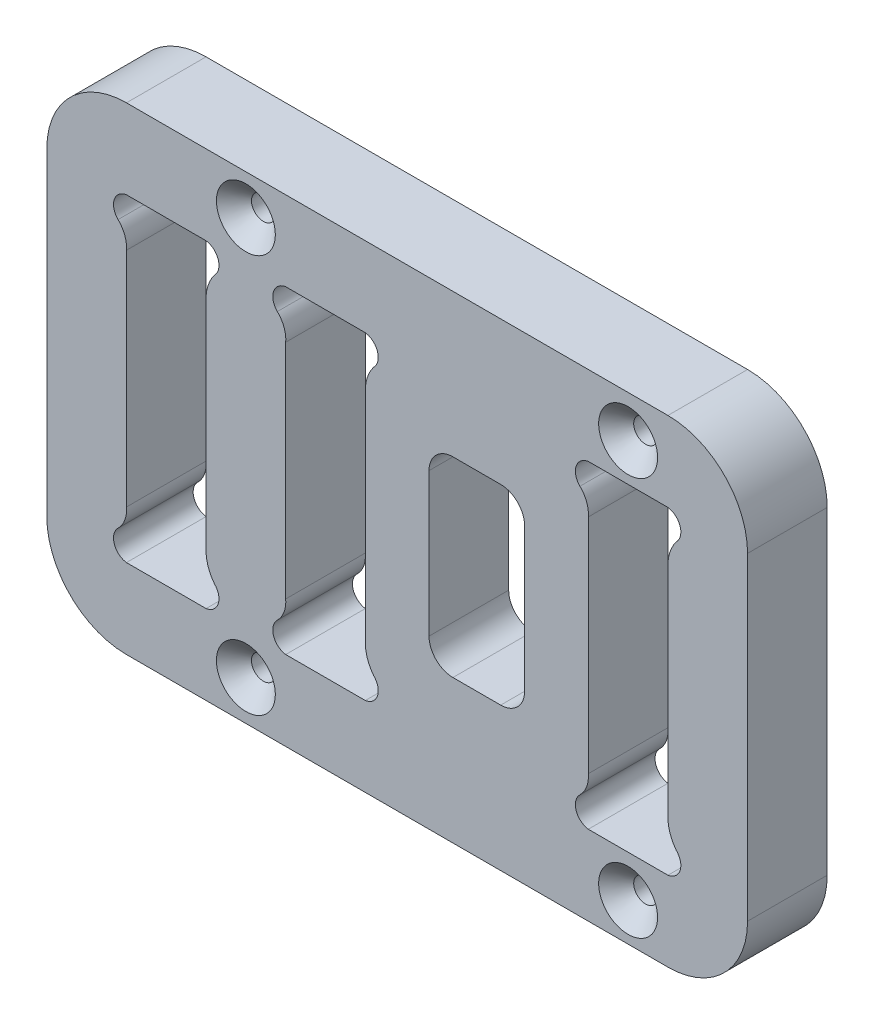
from build123d import *

# Parameters (mm, degrees)
ESQUISSE1_R             = 1.5
BOSS_EXTRU_1_DEPTH      = 10
CHANFREIN1_SIZE         = 2.2
ENL_V_MAT_EXTRU_1_DEPTH = 190.358078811


with BuildPart() as part:
    # Esquisse1 → Boss.-Extru.1 (new body)
    with BuildSketch(Plane.XY):
        with BuildLine():
            Line((-87.488267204, 20.429752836), (-87.488267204, 60.429752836))
            ThreePointArc((-87.488267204, 60.429752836), (-90.417199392, 67.500820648), (-97.488267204, 70.429752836))
            Line((-97.488267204, 70.429752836), (-165.488267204, 70.429752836))
            ThreePointArc((-165.488267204, 70.429752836), (-172.559335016, 67.500820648), (-175.488267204, 60.429752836))
            Line((-175.488267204, 60.429752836), (-175.488267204, 20.429752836))
            ThreePointArc((-175.488267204, 20.429752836), (-172.559335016, 13.358685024), (-165.488267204, 10.429752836))
            Line((-165.488267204, 10.429752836), (-97.488267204, 10.429752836))
            ThreePointArc((-97.488267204, 10.429752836), (-90.417199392, 13.358685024), (-87.488267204, 20.429752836))
        make_face()
        with Locations((-150.488267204, 65.429752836)):
            Circle(ESQUISSE1_R, mode=Mode.SUBTRACT)
        with Locations(Location((-150.488267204, 15.429752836, 0), (0, 0, 180))):
            Circle(ESQUISSE1_R, mode=Mode.SUBTRACT)
        with Locations((-102.488267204, 65.19100666)):
            Circle(ESQUISSE1_R, mode=Mode.SUBTRACT)
        with Locations(Location((-102.488267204, 15.19100666, 0), (0, 0, 180))):
            Circle(ESQUISSE1_R, mode=Mode.SUBTRACT)
        with BuildLine():
            Line((-145.488267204, 60.429752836), (-135.488267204, 60.429752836))
            ThreePointArc((-135.488267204, 60.429752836), (-133.959475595, 59.144976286), (-134.439504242, 57.206567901))
            ThreePointArc((-134.439504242, 57.206567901), (-135.175994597, 55.877234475), (-135.488267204, 54.389944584))
            Line((-135.488267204, 54.389944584), (-135.488267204, 26.469561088))
            ThreePointArc((-135.488267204, 26.469561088), (-135.175994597, 24.982271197), (-134.439504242, 23.652937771))
            ThreePointArc((-134.439504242, 23.652937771), (-133.959475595, 21.714529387), (-135.488267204, 20.429752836))
            Line((-135.488267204, 20.429752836), (-145.488267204, 20.429752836))
            ThreePointArc((-145.488267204, 20.429752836), (-147.017058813, 21.714529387), (-146.537030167, 23.652937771))
            ThreePointArc((-146.537030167, 23.652937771), (-145.695025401, 24.942983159), (-145.488267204, 26.469561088))
            Line((-145.488267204, 26.469561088), (-145.488267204, 54.389944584))
            ThreePointArc((-145.488267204, 54.389944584), (-145.695025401, 55.916522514), (-146.537030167, 57.206567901))
            ThreePointArc((-146.537030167, 57.206567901), (-147.017058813, 59.144976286), (-145.488267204, 60.429752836))
        make_face(mode=Mode.SUBTRACT)
        with BuildLine():
            Line((-165.488267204, 60.429752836), (-155.488267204, 60.429752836))
            ThreePointArc((-155.488267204, 60.429752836), (-153.959475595, 59.144976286), (-154.439504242, 57.206567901))
            ThreePointArc((-154.439504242, 57.206567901), (-155.175994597, 55.877234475), (-155.488267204, 54.389944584))
            Line((-155.488267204, 54.389944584), (-155.488267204, 26.469561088))
            ThreePointArc((-155.488267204, 26.469561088), (-155.175994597, 24.982271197), (-154.439504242, 23.652937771))
            ThreePointArc((-154.439504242, 23.652937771), (-153.959475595, 21.714529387), (-155.488267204, 20.429752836))
            Line((-155.488267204, 20.429752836), (-165.488267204, 20.429752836))
            ThreePointArc((-165.488267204, 20.429752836), (-167.017058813, 21.714529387), (-166.537030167, 23.652937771))
            ThreePointArc((-166.537030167, 23.652937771), (-165.695025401, 24.942983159), (-165.488267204, 26.469561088))
            Line((-165.488267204, 26.469561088), (-165.488267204, 54.389944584))
            ThreePointArc((-165.488267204, 54.389944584), (-165.695025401, 55.916522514), (-166.537030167, 57.206567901))
            ThreePointArc((-166.537030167, 57.206567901), (-167.017058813, 59.144976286), (-165.488267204, 60.429752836))
        make_face(mode=Mode.SUBTRACT)
        with BuildLine():
            Line((-107.488267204, 60.429752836), (-97.488267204, 60.429752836))
            ThreePointArc((-97.488267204, 60.429752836), (-95.959475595, 59.144976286), (-96.439504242, 57.206567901))
            ThreePointArc((-96.439504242, 57.206567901), (-97.175994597, 55.877234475), (-97.488267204, 54.389944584))
            Line((-97.488267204, 54.389944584), (-97.488267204, 26.469561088))
            ThreePointArc((-97.488267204, 26.469561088), (-97.175994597, 24.982271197), (-96.439504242, 23.652937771))
            ThreePointArc((-96.439504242, 23.652937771), (-95.959475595, 21.714529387), (-97.488267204, 20.429752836))
            Line((-97.488267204, 20.429752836), (-107.488267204, 20.429752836))
            ThreePointArc((-107.488267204, 20.429752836), (-109.017058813, 21.714529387), (-108.537030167, 23.652937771))
            ThreePointArc((-108.537030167, 23.652937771), (-107.695025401, 24.942983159), (-107.488267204, 26.469561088))
            Line((-107.488267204, 26.469561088), (-107.488267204, 54.389944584))
            ThreePointArc((-107.488267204, 54.389944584), (-107.695025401, 55.916522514), (-108.537030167, 57.206567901))
            ThreePointArc((-108.537030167, 57.206567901), (-109.017058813, 59.144976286), (-107.488267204, 60.429752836))
        make_face(mode=Mode.SUBTRACT)
    extrude(amount=BOSS_EXTRU_1_DEPTH)

    # Chanfrein1
    chanfrein1_edges = [part.edges().sort_by_distance(p)[0] for p in [
        (-148.988267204, 15.429752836, 10),
        (-103.988267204, 65.19100666, 10),
        (-100.988267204, 15.19100666, 10),
        (-151.988267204, 65.429752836, 10),
    ]]
    chamfer(chanfrein1_edges, length=CHANFREIN1_SIZE)

    # Esquisse2 → Enl_v. mat.-Extru.1 (cut, through all)
    with BuildSketch(Plane(origin=(0, 0, 0), x_dir=(-1, 0, 0), z_dir=(0, 0, -1))):
        with BuildLine():
            Line((118.488267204, 52.429752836), (124.488267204, 52.429752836))
            ThreePointArc((124.488267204, 52.429752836), (126.609587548, 51.55107318), (127.488267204, 49.429752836))
            Line((127.488267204, 49.429752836), (127.488267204, 31.429752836))
            ThreePointArc((127.488267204, 31.429752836), (126.609587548, 29.308432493), (124.488267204, 28.429752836))
            Line((124.488267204, 28.429752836), (118.488267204, 28.429752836))
            ThreePointArc((118.488267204, 28.429752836), (116.36694686, 29.308432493), (115.488267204, 31.429752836))
            Line((115.488267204, 31.429752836), (115.488267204, 49.429752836))
            ThreePointArc((115.488267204, 49.429752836), (116.36694686, 51.55107318), (118.488267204, 52.429752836))
        make_face()
    extrude(amount=-ENL_V_MAT_EXTRU_1_DEPTH, mode=Mode.SUBTRACT)


solid = part.part
